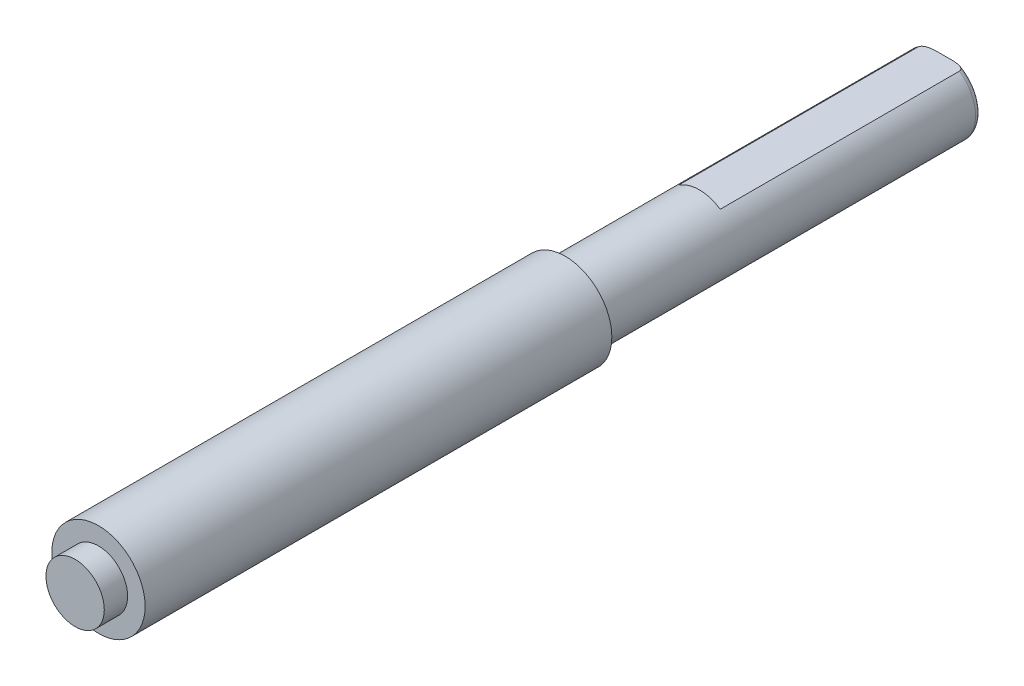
from build123d import *

# Parameters (mm, degrees)
SKETCH_2_R          = 3.175
EXTRUDE_1_DEPTH     = 32.5
SKETCH_3_R          = 4
EXTRUDE_2_DEPTH     = 40
CUT_EXTRUDE_1_DEPTH = 21
SKETCH_5_R          = 2.5
EXTRUDE_3_DEPTH     = 2
FILLET_1_R          = 0.5


with BuildPart() as part:
    # Sketch 2 → Extrude 1 (new body)
    with BuildSketch(Plane.XY):
        Circle(SKETCH_2_R)
    extrude(amount=EXTRUDE_1_DEPTH)

    # Sketch 3 → Extrude 2 (add)
    with BuildSketch(Plane.XY.offset(32.5)):
        Circle(SKETCH_3_R)
    extrude(amount=EXTRUDE_2_DEPTH)

    # Sketch 4 → Cut-Extrude 1 (cut)
    with BuildSketch(Plane(origin=(0, 0, 0), x_dir=(-1, 0, 0), z_dir=(0, 0, -1))):
        with BuildLine():
            Line((-1.78605711, 2.625), (1.78605711, 2.625))
            ThreePointArc((1.78605711, 2.625), (0, 3.175), (-1.78605711, 2.625))
        make_face()
    extrude(amount=-CUT_EXTRUDE_1_DEPTH, mode=Mode.SUBTRACT)

    # Sketch 5 → Extrude 3 (add)
    with BuildSketch(Plane.XY.offset(72.5)):
        Circle(SKETCH_5_R)
    extrude(amount=EXTRUDE_3_DEPTH)

    # Fillet 1
    fillet_1_edges = [part.edges().sort_by_distance(p)[0] for p in [
        (-1.48490634, -2.806363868, 0),
    ]]
    fillet(fillet_1_edges, radius=FILLET_1_R)


solid = part.part
